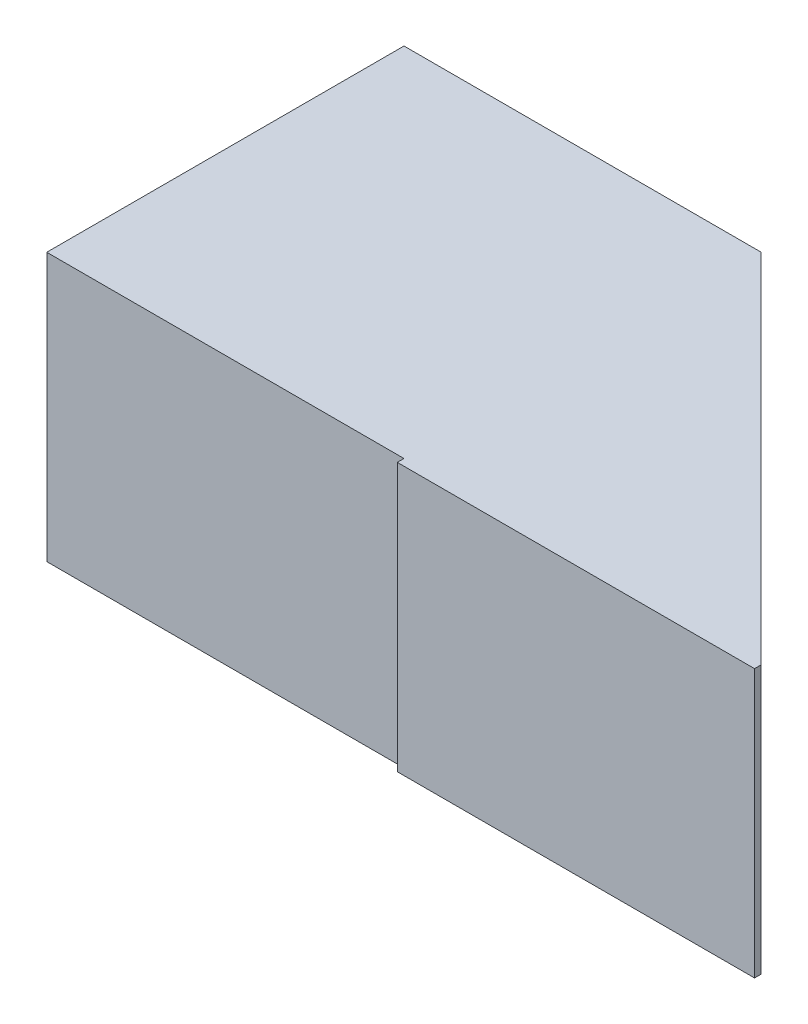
from build123d import *

# Parameters (mm, degrees)
EXTRUDE_1_DEPTH = 6
SKETCH_2_W      = 8
SKETCH_2_H      = 6
EXTRUDE_2_DEPTH = 0.15


with BuildPart() as part:
    # Sketch 1 → Extrude 1 (new body)
    with BuildSketch(Plane(origin=(0, 0, 0), x_dir=(1, 0, 0), z_dir=(0, 1, 0))):
        Polygon((0, 0), (16, 0), (8, 8), (0, 8), align=None)
    extrude(amount=EXTRUDE_1_DEPTH)

    # Sketch 2 → Extrude 2 (add)
    with BuildSketch(Plane.XY):
        with Locations((12, 3)):
            Rectangle(SKETCH_2_W, SKETCH_2_H)
    extrude(amount=EXTRUDE_2_DEPTH)


solid = part.part
